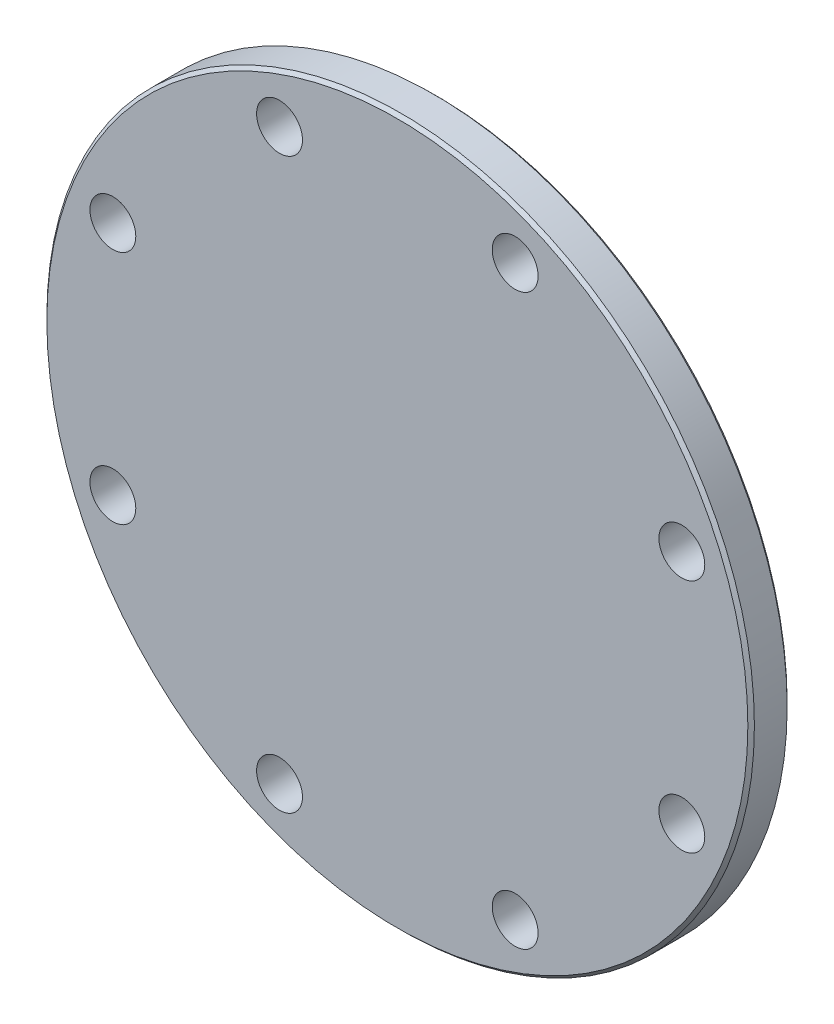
from build123d import *

# Parameters (mm, degrees)
SKETCH1_R                    = 171.45
BOSS_EXTRUDE1_DEPTH          = 19.05
F_7_8_0_875_DIAMETER_HOLE1_D = 22.225
CIRPATTERN1_COUNT            = 8
CHAMFER1_SIZE                = 1.5875


with BuildPart() as part:
    # Sketch1 → Boss-Extrude1 (new body)
    with BuildSketch(Plane.XY):
        with Locations(Location((0, 0, 0), (0, 0, 180))):
            Circle(SKETCH1_R)
    extrude(amount=BOSS_EXTRUDE1_DEPTH)

    # 7_8 _0.875_ Diameter Hole1 (through all)
    with Locations(Plane.XY.offset(19.05)):
        with Locations((-137.865923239, 57.105935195)):
            f_7_8_0_875_diameter_hole1 = Hole(F_7_8_0_875_DIAMETER_HOLE1_D / 2)

    # CirPattern1: 7_8 _0.875_ Diameter Hole1 ×8 about axis
    cirpattern1_axis = Axis((0, 0, 0), (0, 0, 1))
    for i in range(1, CIRPATTERN1_COUNT):
        add(f_7_8_0_875_diameter_hole1.rotate(cirpattern1_axis, i * 360 / CIRPATTERN1_COUNT), mode=Mode.SUBTRACT)

    # Chamfer1
    chamfer1_edges = [part.edges().sort_by_distance(p)[0] for p in [
        (171.45, 0, 0),
        (171.45, 0, 19.05),
    ]]
    chamfer(chamfer1_edges, length=CHAMFER1_SIZE)


solid = part.part
